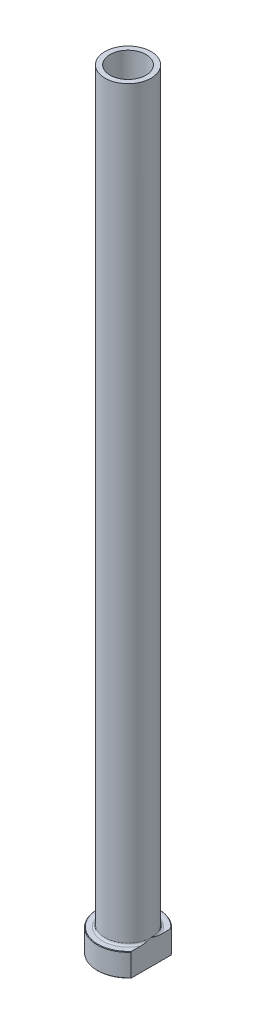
from build123d import *

# Parameters (mm, degrees)
FILLET1_R          = 0.8
CHAMFER1_SIZE      = 0.2
CUT_EXTRUDE1_DEPTH = 301.479616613
CHAMFER2_SIZE      = 0.5


with BuildPart() as part:
    # Sketch1 → Revolve1 (revolve)
    with BuildSketch(Plane.XY, mode=Mode.PRIVATE) as revolve1_sk:
        Polygon((-7, 300), (-9, 300), (-9, 9), (-12, 9), (-12, 0), (-7.25, 0), (-7.25, 233), (-7, 245), align=None)
    revolve(revolve1_sk.sketch.rotate(Axis((0, 92.187680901, 0), (0, -1, 0)), 270), axis=Axis((0, 92.187680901, 0), (0, -1, 0)))

    # Fillet1
    fillet1_edges = [part.edges().sort_by_distance(p)[0] for p in [
        (0, 9, -9),
    ]]
    fillet(fillet1_edges, radius=FILLET1_R)

    # Chamfer1
    chamfer1_edges = [part.edges().sort_by_distance(p)[0] for p in [
        (0, 0, -12),
        (0, 9, -12),
    ]]
    chamfer(chamfer1_edges, length=CHAMFER1_SIZE)

    # Sketch2 → Cut-Extrude1 (cut, through all)
    with BuildSketch(Plane.XZ):
        with BuildLine():
            Line((9, 7.937253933), (9, -7.937253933))
            ThreePointArc((9, -7.937253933), (12, 0), (9, 7.937253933))
        make_face()
    extrude(amount=-CUT_EXTRUDE1_DEPTH, mode=Mode.SUBTRACT)

    # Chamfer2
    chamfer2_edges = [part.edges().sort_by_distance(p)[0] for p in [
        (0, 0, -7.25),
    ]]
    chamfer(chamfer2_edges, length=CHAMFER2_SIZE)


solid = part.part
